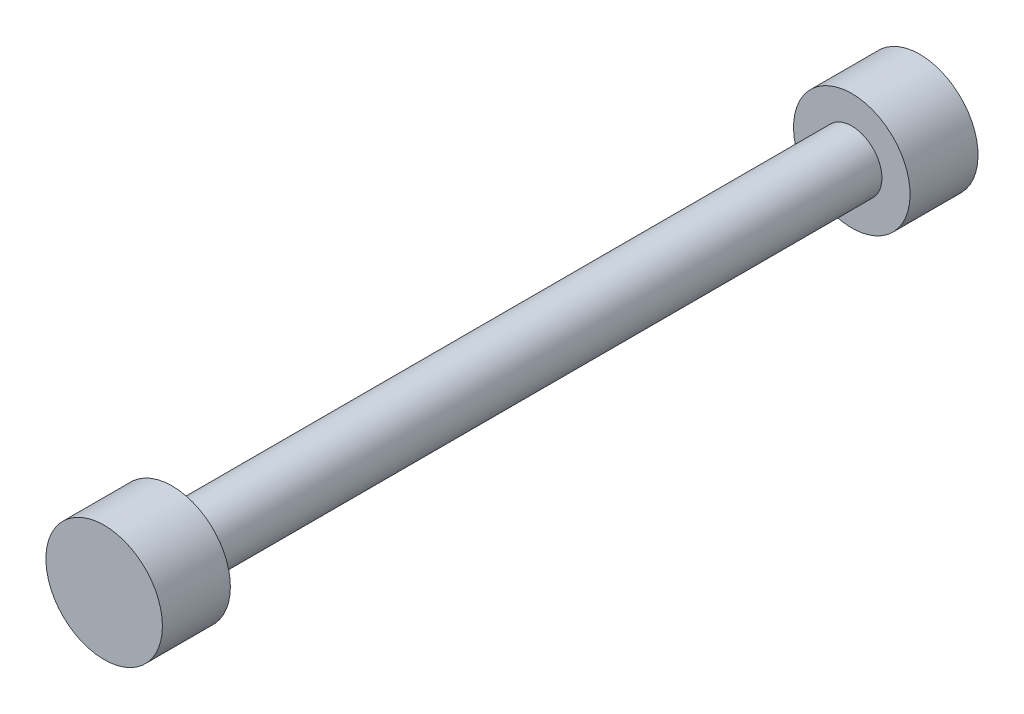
from build123d import *

# Parameters (mm, degrees)
SKETCH1_R           = 9.525
BOSS_EXTRUDE1_DEPTH = 11.1125
SKETCH2_R           = 4.92379
BOSS_EXTRUDE2_DEPTH = 123.825
SKETCH4_R           = 9.525
BOSS_EXTRUDE3_DEPTH = 11.11249743


with BuildPart() as part:
    # Sketch1 → Boss-Extrude1 (new body)
    with BuildSketch(Plane.XY):
        Circle(SKETCH1_R)
    extrude(amount=-BOSS_EXTRUDE1_DEPTH)

    # Sketch2 → Boss-Extrude2 (add)
    with BuildSketch(Plane(origin=(0, 0, -11.1125), x_dir=(-1, 0, 0), z_dir=(0, 0, -1))):
        Circle(SKETCH2_R)
    extrude(amount=BOSS_EXTRUDE2_DEPTH)

    # Sketch4 → Boss-Extrude3 (add)
    with BuildSketch(Plane(origin=(0, 0, -122.2375), x_dir=(-1, 0, 0), z_dir=(0, 0, -1))):
        with Locations(Location((0, 0, 0), (0, 0, 180))):
            Circle(SKETCH4_R)
    extrude(amount=BOSS_EXTRUDE3_DEPTH)


solid = part.part
